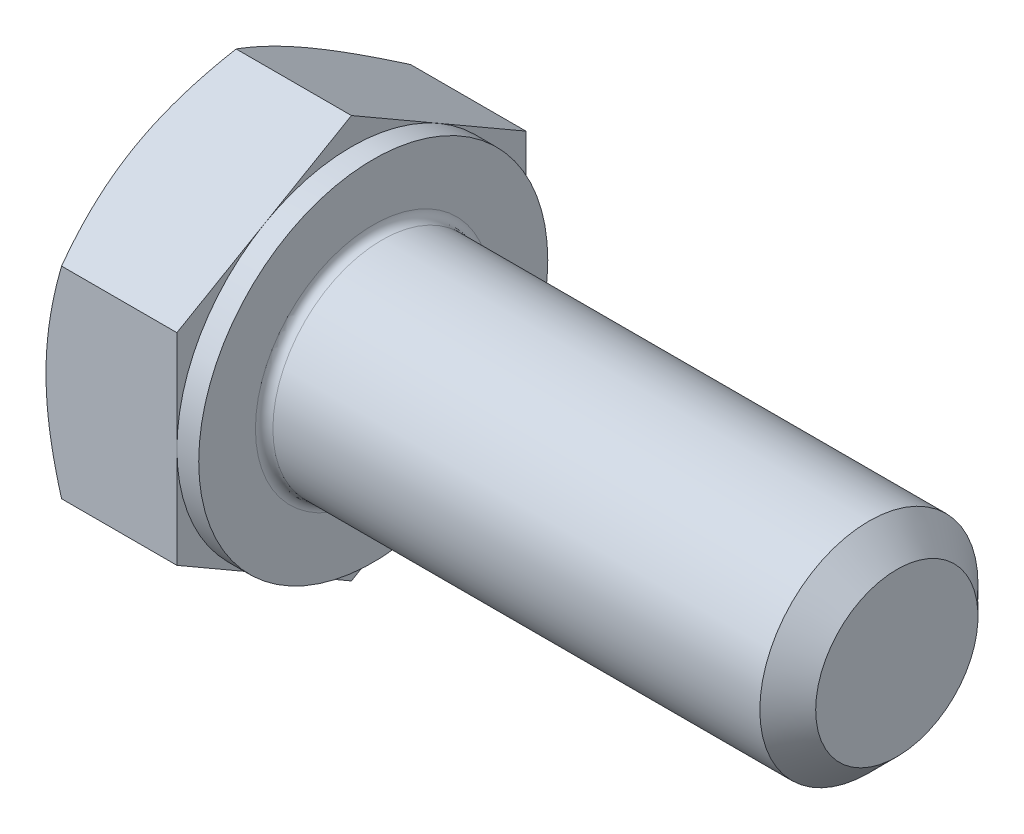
from build123d import *

# Parameters (mm, degrees)
EXTRUDE_358_DEPTH = 3.5
SKETCH_4_W        = 0.5
SKETCH_4_H        = 10.618802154
CHAMFER_1883_SIZE = 0.64
FILLET_1928_R     = 0.2


with BuildPart() as part:
    # Sketch 1 → Extrude 358 (new body)
    with BuildSketch(Plane(origin=(0, 0, 0), x_dir=(0, 0, -1), z_dir=(1, 0, 0))):
        Polygon((4, 2.309401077), (4, -2.309401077), (0, -4.618802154), (-4, -2.309401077), (-4, 2.309401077), (0, 4.618802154), align=None)
    extrude(amount=EXTRUDE_358_DEPTH)

    # Sketch 2 → Revolve 1 (revolve)
    with BuildSketch(Plane.XY, mode=Mode.PRIVATE) as revolve_1_sk:
        Polygon((0, 0), (15.5, 0), (15.5, 1.8072), (15.5, 2.5), (0, 2.5), align=None)
    revolve(revolve_1_sk.sketch.rotate(Axis((0, 0, 0), (1, 0, 0)), 90), axis=Axis((0, 0, 0), (1, 0, 0)))

    # Sketch 3 → Cut-Revolve 1 (revolve, cut)
    with BuildSketch(Plane.XY):
        Polygon((0, 4), (3.244016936, 9.618802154), (3.244016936, 14.618802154), (-10, 14.618802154), (-10, 4), align=None)
    revolve(axis=Axis((0, 0, 0), (1, 0, 0)), mode=Mode.SUBTRACT)

    # Sketch 5 → Cut-Revolve 2 (revolve, cut)
    with BuildSketch(Plane.XY):
        Polygon((3.5, 4), (0.255983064, 9.618802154), (0.255983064, 14.618802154), (10.255983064, 14.618802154), (10.255983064, 4), align=None)
    revolve(axis=Axis((0, 0, 0), (1, 0, 0)), mode=Mode.SUBTRACT)

    # Sketch 4 → Cut-Revolve 3 (revolve, cut)
    with BuildSketch(Plane.XY, mode=Mode.PRIVATE) as cut_revolve_3_sk:
        with Locations((3.25, 9.309401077)):
            Rectangle(SKETCH_4_W, SKETCH_4_H)
    revolve(cut_revolve_3_sk.sketch.rotate(Axis((0, 0, 0), (1, 0, 0)), 270), axis=Axis((0, 0, 0), (1, 0, 0)), mode=Mode.SUBTRACT)

    # Chamfer 1883
    chamfer_1883_edges = [part.edges().sort_by_distance(p)[0] for p in [
        (15.5, 0, -2.5),
    ]]
    chamfer(chamfer_1883_edges, length=CHAMFER_1883_SIZE)

    # Fillet 1928
    fillet_1928_edges = [part.edges().sort_by_distance(p)[0] for p in [
        (3.5, 0, -2.5),
    ]]
    fillet(fillet_1928_edges, radius=FILLET_1928_R)


solid = part.part
